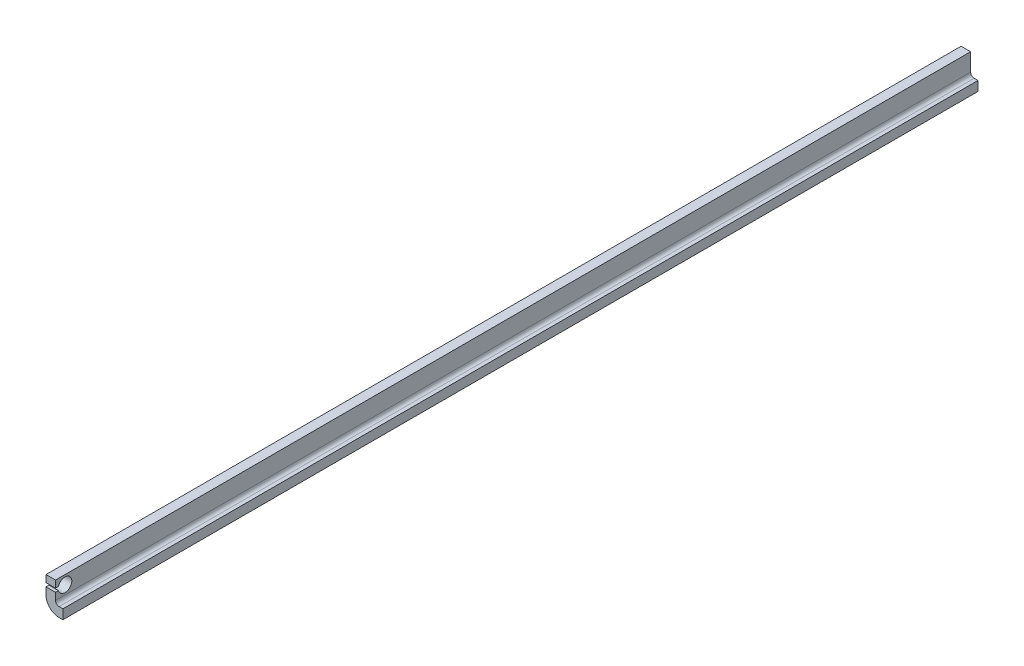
from build123d import *

# Parameters (mm, degrees)
LONGUEUR_DEPTH           = 101.12425
TROU_POUR_GOUPILLE_DEPTH = 102.499512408


with BuildPart() as part:
    # Esquisse1 → Longueur (new body)
    with BuildSketch(Plane.XY):
        with BuildLine():
            Line((-1.08834657, -5.121592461), (-2.141668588, -5.121592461))
            Line((-2.141668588, -5.121592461), (-2.141668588, -7.07415347))
            ThreePointArc((-2.141668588, -7.07415347), (-1.718932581, -8.094728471), (-0.698357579, -8.517464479))
            Line((-0.698357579, -8.517464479), (-0.27354657, -8.517464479))
            Line((-0.27354657, -8.517464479), (-0.27354657, -7.464142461))
            Line((-0.27354657, -7.464142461), (-0.698357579, -7.464142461))
            ThreePointArc((-0.698357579, -7.464142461), (-0.974121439, -7.34991733), (-1.08834657, -7.07415347))
            Line((-1.08834657, -7.07415347), (-1.08834657, -5.121592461))
        make_face()
    extrude(amount=LONGUEUR_DEPTH)

    # Esquisse2 → Trou pour goupille (cut, through all)
    with BuildSketch(Plane.ZY.offset(2.141668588)):
        with BuildLine():
            Line((100.797091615, -5.897872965), (101.12425, -5.897872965))
            Line((101.12425, -5.897872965), (101.12425, -6.297872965))
            Line((101.12425, -6.297872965), (100.797091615, -6.297872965))
            ThreePointArc((100.797091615, -6.297872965), (99.32425, -6.097872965), (100.797091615, -5.897872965))
        make_face()
    extrude(amount=-TROU_POUR_GOUPILLE_DEPTH, mode=Mode.SUBTRACT)


solid = part.part
